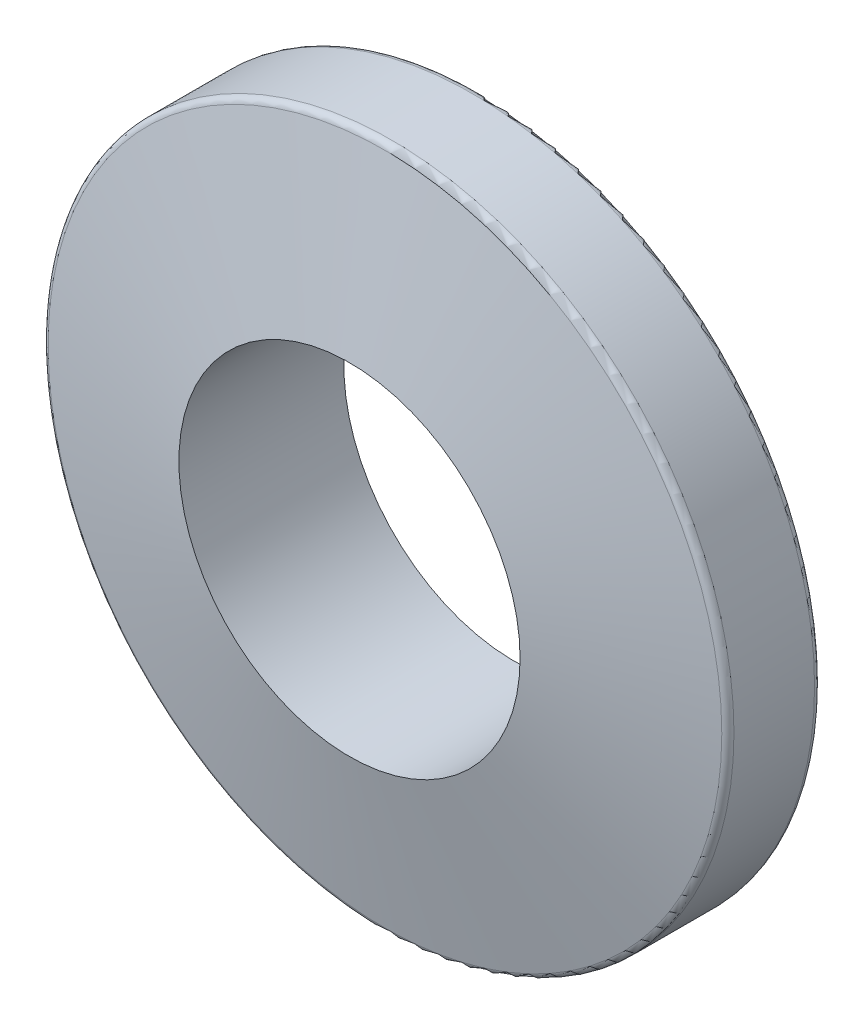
from build123d import *

# Parameters (mm, degrees)
FILLET1_R = 0.0635


with BuildPart() as part:
    # Sketch1 → Revolve1 (revolve)
    with BuildSketch(Plane(origin=(0, 0, 0), x_dir=(1, 0, 0), z_dir=(0, 1, 0))):
        Polygon((3.1623, 0.549486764), (3.1623, 1.397), (1.57607, 1.735243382), (1.57607, 0.211243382), align=None)
    revolve(axis=Axis((0, 0, 0), (0, 0, -1)))

    # Fillet1
    fillet1_edges = [part.edges().sort_by_distance(p)[0] for p in [
        (-3.1623, 0, -1.397),
        (-3.1623, 0, -0.549486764),
    ]]
    fillet(fillet1_edges, radius=FILLET1_R)


solid = part.part
